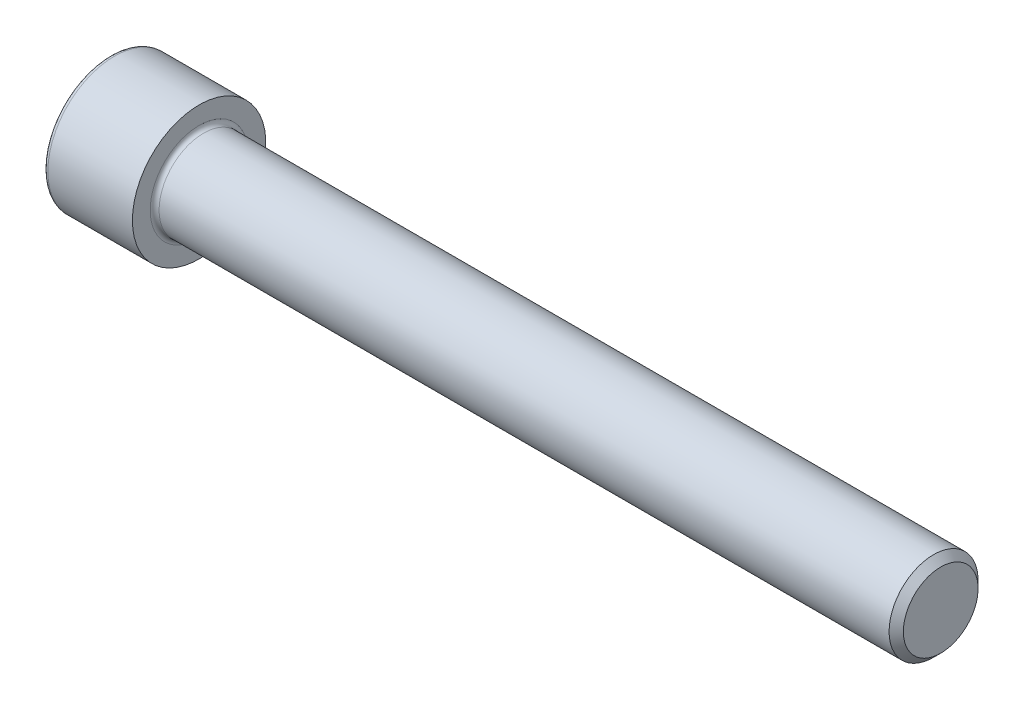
ISO-10303-21;
HEADER;
FILE_DESCRIPTION(('STEP AP214'),'2;1');
FILE_NAME('part.step','',(''),(''),'','','');
FILE_SCHEMA(('AUTOMOTIVE_DESIGN { 1 0 10303 214 1 1 1 1 }'));
ENDSEC;
DATA;
#1=APPLICATION_CONTEXT('core data for automotive mechanical design processes');
#2=APPLICATION_PROTOCOL_DEFINITION('international standard','automotive_design',2000,#1);
#3=PRODUCT_CONTEXT('',#1,'mechanical');
#4=PRODUCT('Part','Part','',(#3));
#5=PRODUCT_RELATED_PRODUCT_CATEGORY('part','',(#4));
#6=PRODUCT_DEFINITION_FORMATION('','',#4);
#7=PRODUCT_DEFINITION_CONTEXT('part definition',#1,'design');
#8=PRODUCT_DEFINITION('design','',#6,#7);
#9=PRODUCT_DEFINITION_SHAPE('','',#8);
#10=(LENGTH_UNIT() NAMED_UNIT(*) SI_UNIT(.MILLI.,.METRE.));
#11=(NAMED_UNIT(*) PLANE_ANGLE_UNIT() SI_UNIT($,.RADIAN.));
#12=(NAMED_UNIT(*) SI_UNIT($,.STERADIAN.) SOLID_ANGLE_UNIT());
#13=UNCERTAINTY_MEASURE_WITH_UNIT(LENGTH_MEASURE(1.E-05),#10,'distance_accuracy_value','');
#14=(GEOMETRIC_REPRESENTATION_CONTEXT(3) GLOBAL_UNCERTAINTY_ASSIGNED_CONTEXT((#13)) GLOBAL_UNIT_ASSIGNED_CONTEXT((#10,
#11,#12)) REPRESENTATION_CONTEXT('',''));
#15=CARTESIAN_POINT('',(0.,0.,0.));
#16=DIRECTION('',(0.,0.,1.));
#17=DIRECTION('',(1.,0.,0.));
#18=AXIS2_PLACEMENT_3D('',#15,#16,#17);
#19=CARTESIAN_POINT('',(0.,0.,0.));
#20=DIRECTION('',(-1.,0.,0.));
#21=DIRECTION('',(0.,0.,1.));
#22=AXIS2_PLACEMENT_3D('',#19,#20,#21);
#23=PLANE('',#22);
#24=DIRECTION('',(0.,-0.499999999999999,0.866025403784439));
#25=VECTOR('',#24,1.);
#26=CARTESIAN_POINT('',(0.,5.83989797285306,0.));
#27=LINE('',#26,#25);
#28=CARTESIAN_POINT('',(0.,5.83989797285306,0.));
#29=VERTEX_POINT('',#28);
#30=CARTESIAN_POINT('',(0.,2.91994898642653,5.05749999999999));
#31=VERTEX_POINT('',#30);
#32=EDGE_CURVE('E266',#29,#31,#27,.T.);
#33=ORIENTED_EDGE('',*,*,#32,.T.);
#34=DIRECTION('',(0.,1.,0.));
#35=VECTOR('',#34,1.);
#36=CARTESIAN_POINT('',(0.,-2.91994898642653,5.05750000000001));
#37=LINE('',#36,#35);
#38=CARTESIAN_POINT('',(0.,-2.91994898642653,5.05750000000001));
#39=VERTEX_POINT('',#38);
#40=EDGE_CURVE('E138',#39,#31,#37,.T.);
#41=ORIENTED_EDGE('',*,*,#40,.F.);
#42=DIRECTION('',(0.,-0.500000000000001,-0.866025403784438));
#43=VECTOR('',#42,1.);
#44=CARTESIAN_POINT('',(0.,-2.91994898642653,5.05750000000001));
#45=LINE('',#44,#43);
#46=CARTESIAN_POINT('',(0.,-5.83989797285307,0.));
#47=VERTEX_POINT('',#46);
#48=EDGE_CURVE('E269',#39,#47,#45,.T.);
#49=ORIENTED_EDGE('',*,*,#48,.T.);
#50=DIRECTION('',(0.,0.499999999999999,-0.866025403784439));
#51=VECTOR('',#50,1.);
#52=CARTESIAN_POINT('',(0.,-5.83989797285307,0.));
#53=LINE('',#52,#51);
#54=CARTESIAN_POINT('',(0.,-2.91994898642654,-5.05749999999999));
#55=VERTEX_POINT('',#54);
#56=EDGE_CURVE('E272',#47,#55,#53,.T.);
#57=ORIENTED_EDGE('',*,*,#56,.T.);
#58=DIRECTION('',(0.,-1.,0.));
#59=VECTOR('',#58,1.);
#60=CARTESIAN_POINT('',(0.,2.91994898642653,-5.05750000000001));
#61=LINE('',#60,#59);
#62=CARTESIAN_POINT('',(0.,2.91994898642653,-5.05750000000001));
#63=VERTEX_POINT('',#62);
#64=EDGE_CURVE('E275',#63,#55,#61,.T.);
#65=ORIENTED_EDGE('',*,*,#64,.F.);
#66=DIRECTION('',(0.,-0.500000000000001,-0.866025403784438));
#67=VECTOR('',#66,1.);
#68=CARTESIAN_POINT('',(0.,5.83989797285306,0.));
#69=LINE('',#68,#67);
#70=EDGE_CURVE('E133',#29,#63,#69,.T.);
#71=ORIENTED_EDGE('',*,*,#70,.F.);
#72=EDGE_LOOP('',(#33,#41,#49,#57,#65,#71));
#73=FACE_BOUND('',#72,.T.);
#74=CARTESIAN_POINT('',(0.,0.,0.));
#75=DIRECTION('',(-1.,0.,0.));
#76=DIRECTION('',(0.,0.,1.));
#77=AXIS2_PLACEMENT_3D('',#74,#75,#76);
#78=CIRCLE('',#77,8.4);
#79=CARTESIAN_POINT('',(0.,0.,8.4));
#80=VERTEX_POINT('',#79);
#81=EDGE_CURVE('E50',#80,#80,#78,.T.);
#82=ORIENTED_EDGE('',*,*,#81,.T.);
#83=EDGE_LOOP('',(#82));
#84=FACE_BOUND('',#83,.T.);
#85=ADVANCED_FACE('F42',(#73,#84),#23,.T.);
#86=CARTESIAN_POINT('',(-31.7499999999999,0.,0.));
#87=DIRECTION('',(-1.,0.,0.));
#88=DIRECTION('',(0.,0.,1.));
#89=AXIS2_PLACEMENT_3D('',#86,#87,#88);
#90=CYLINDRICAL_SURFACE('',#89,9.);
#91=CARTESIAN_POINT('',(0.599999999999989,0.,0.));
#92=DIRECTION('',(-1.,0.,0.));
#93=DIRECTION('',(0.,0.,1.));
#94=AXIS2_PLACEMENT_3D('',#91,#92,#93);
#95=CIRCLE('',#94,9.);
#96=CARTESIAN_POINT('',(0.599999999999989,0.,9.));
#97=VERTEX_POINT('',#96);
#98=EDGE_CURVE('E13',#97,#97,#95,.F.);
#99=ORIENTED_EDGE('',*,*,#98,.T.);
#100=EDGE_LOOP('',(#99));
#101=FACE_BOUND('',#100,.T.);
#102=CARTESIAN_POINT('',(12.,0.,0.));
#103=DIRECTION('',(-1.,0.,0.));
#104=DIRECTION('',(0.,0.,1.));
#105=AXIS2_PLACEMENT_3D('',#102,#103,#104);
#106=CIRCLE('',#105,9.);
#107=CARTESIAN_POINT('',(12.,0.,9.));
#108=VERTEX_POINT('',#107);
#109=EDGE_CURVE('E156',#108,#108,#106,.T.);
#110=ORIENTED_EDGE('',*,*,#109,.T.);
#111=EDGE_LOOP('',(#110));
#112=FACE_BOUND('',#111,.T.);
#113=ADVANCED_FACE('F180',(#101,#112),#90,.T.);
#114=CARTESIAN_POINT('',(12.,8.99999999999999,0.));
#115=DIRECTION('',(1.,0.,0.));
#116=DIRECTION('',(0.,0.,-1.));
#117=AXIS2_PLACEMENT_3D('',#114,#115,#116);
#118=PLANE('',#117);
#119=CARTESIAN_POINT('',(12.,0.,0.));
#120=DIRECTION('',(1.,0.,0.));
#121=DIRECTION('',(0.,0.,-1.));
#122=AXIS2_PLACEMENT_3D('',#119,#120,#121);
#123=CIRCLE('',#122,6.59999999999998);
#124=CARTESIAN_POINT('',(12.,0.,-6.59999999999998));
#125=VERTEX_POINT('',#124);
#126=EDGE_CURVE('E159',#125,#125,#123,.F.);
#127=ORIENTED_EDGE('',*,*,#126,.T.);
#128=EDGE_LOOP('',(#127));
#129=FACE_BOUND('',#128,.T.);
#130=ORIENTED_EDGE('',*,*,#109,.F.);
#131=EDGE_LOOP('',(#130));
#132=FACE_BOUND('',#131,.T.);
#133=ADVANCED_FACE('F186',(#129,#132),#118,.T.);
#134=CARTESIAN_POINT('',(-31.7499999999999,0.,0.));
#135=DIRECTION('',(-1.,0.,0.));
#136=DIRECTION('',(0.,0.,1.));
#137=AXIS2_PLACEMENT_3D('',#134,#135,#136);
#138=CYLINDRICAL_SURFACE('',#137,5.99999999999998);
#139=CARTESIAN_POINT('',(12.6,0.,0.));
#140=DIRECTION('',(1.,0.,0.));
#141=DIRECTION('',(0.,0.,-1.));
#142=AXIS2_PLACEMENT_3D('',#139,#140,#141);
#143=CIRCLE('',#142,5.99999999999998);
#144=CARTESIAN_POINT('',(12.6,0.,-5.99999999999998));
#145=VERTEX_POINT('',#144);
#146=EDGE_CURVE('E162',#145,#145,#143,.T.);
#147=ORIENTED_EDGE('',*,*,#146,.T.);
#148=EDGE_LOOP('',(#147));
#149=FACE_BOUND('',#148,.T.);
#150=CARTESIAN_POINT('',(111.036,0.,0.));
#151=DIRECTION('',(-1.,0.,0.));
#152=DIRECTION('',(0.,0.,1.));
#153=AXIS2_PLACEMENT_3D('',#150,#151,#152);
#154=CIRCLE('',#153,5.99999999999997);
#155=CARTESIAN_POINT('',(111.036,0.,5.99999999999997));
#156=VERTEX_POINT('',#155);
#157=EDGE_CURVE('E153',#156,#156,#154,.T.);
#158=ORIENTED_EDGE('',*,*,#157,.T.);
#159=EDGE_LOOP('',(#158));
#160=FACE_BOUND('',#159,.T.);
#161=ADVANCED_FACE('F192',(#149,#160),#138,.T.);
#162=CARTESIAN_POINT('',(112.,0.,0.));
#163=DIRECTION('',(-1.,0.,0.));
#164=DIRECTION('',(0.,0.,1.));
#165=AXIS2_PLACEMENT_3D('',#162,#163,#164);
#166=CONICAL_SURFACE('',#165,5.036,0.785398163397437);
#167=ORIENTED_EDGE('',*,*,#157,.F.);
#168=EDGE_LOOP('',(#167));
#169=FACE_BOUND('',#168,.T.);
#170=CARTESIAN_POINT('',(112.,0.,0.));
#171=DIRECTION('',(-1.,0.,0.));
#172=DIRECTION('',(0.,0.,1.));
#173=AXIS2_PLACEMENT_3D('',#170,#171,#172);
#174=CIRCLE('',#173,5.036);
#175=CARTESIAN_POINT('',(112.,0.,5.036));
#176=VERTEX_POINT('',#175);
#177=EDGE_CURVE('E149',#176,#176,#174,.T.);
#178=ORIENTED_EDGE('',*,*,#177,.T.);
#179=EDGE_LOOP('',(#178));
#180=FACE_BOUND('',#179,.T.);
#181=ADVANCED_FACE('F196',(#169,#180),#166,.T.);
#182=CARTESIAN_POINT('',(112.,5.036,0.));
#183=DIRECTION('',(1.,0.,0.));
#184=DIRECTION('',(0.,0.,-1.));
#185=AXIS2_PLACEMENT_3D('',#182,#183,#184);
#186=PLANE('',#185);
#187=ORIENTED_EDGE('',*,*,#177,.F.);
#188=EDGE_LOOP('',(#187));
#189=FACE_BOUND('',#188,.T.);
#190=ADVANCED_FACE('F176',(#189),#186,.T.);
#191=CARTESIAN_POINT('',(12.6,0.,0.));
#192=DIRECTION('',(1.,0.,0.));
#193=DIRECTION('',(0.,0.,-1.));
#194=AXIS2_PLACEMENT_3D('',#191,#192,#193);
#195=TOROIDAL_SURFACE('',#194,6.59999999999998,0.6);
#196=ORIENTED_EDGE('',*,*,#146,.F.);
#197=EDGE_LOOP('',(#196));
#198=FACE_BOUND('',#197,.T.);
#199=ORIENTED_EDGE('',*,*,#126,.F.);
#200=EDGE_LOOP('',(#199));
#201=FACE_BOUND('',#200,.T.);
#202=ADVANCED_FACE('F169',(#198,#201),#195,.F.);
#203=CARTESIAN_POINT('',(0.599999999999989,0.,0.));
#204=DIRECTION('',(-1.,0.,0.));
#205=DIRECTION('',(0.,0.,1.));
#206=AXIS2_PLACEMENT_3D('',#203,#204,#205);
#207=TOROIDAL_SURFACE('',#206,8.4,0.6);
#208=ORIENTED_EDGE('',*,*,#98,.F.);
#209=EDGE_LOOP('',(#208));
#210=FACE_BOUND('',#209,.T.);
#211=ORIENTED_EDGE('',*,*,#81,.F.);
#212=EDGE_LOOP('',(#211));
#213=FACE_BOUND('',#212,.T.);
#214=ADVANCED_FACE('F44',(#210,#213),#207,.T.);
#215=CARTESIAN_POINT('',(6.00000000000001,5.83989797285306,0.));
#216=DIRECTION('',(0.,-0.866025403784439,-0.499999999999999));
#217=DIRECTION('',(0.,0.499999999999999,-0.866025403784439));
#218=AXIS2_PLACEMENT_3D('',#215,#216,#217);
#219=PLANE('',#218);
#220=ORIENTED_EDGE('',*,*,#32,.F.);
#221=DIRECTION('',(-1.,0.,0.));
#222=VECTOR('',#221,1.);
#223=CARTESIAN_POINT('',(6.00000000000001,5.83989797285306,0.));
#224=LINE('',#223,#222);
#225=CARTESIAN_POINT('',(6.00000000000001,5.83989797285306,0.));
#226=VERTEX_POINT('',#225);
#227=EDGE_CURVE('E256',#226,#29,#224,.T.);
#228=ORIENTED_EDGE('',*,*,#227,.F.);
#229=DIRECTION('',(0.,-0.499999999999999,0.866025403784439));
#230=VECTOR('',#229,1.);
#231=CARTESIAN_POINT('',(6.00000000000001,5.83989797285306,0.));
#232=LINE('',#231,#230);
#233=CARTESIAN_POINT('',(6.00000000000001,4.37992347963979,2.52875));
#234=VERTEX_POINT('',#233);
#235=EDGE_CURVE('E125',#226,#234,#232,.T.);
#236=ORIENTED_EDGE('',*,*,#235,.T.);
#237=CARTESIAN_POINT('',(6.00000000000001,2.91994898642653,5.05749999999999));
#238=VERTEX_POINT('',#237);
#239=EDGE_CURVE('E116',#234,#238,#232,.T.);
#240=ORIENTED_EDGE('',*,*,#239,.T.);
#241=DIRECTION('',(-1.,0.,0.));
#242=VECTOR('',#241,1.);
#243=CARTESIAN_POINT('',(6.00000000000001,2.91994898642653,5.05749999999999));
#244=LINE('',#243,#242);
#245=EDGE_CURVE('E130',#238,#31,#244,.T.);
#246=ORIENTED_EDGE('',*,*,#245,.T.);
#247=EDGE_LOOP('',(#220,#228,#236,#240,#246));
#248=FACE_BOUND('',#247,.T.);
#249=ADVANCED_FACE('F129',(#248),#219,.T.);
#250=CARTESIAN_POINT('',(6.00000000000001,-2.91994898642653,5.05750000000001));
#251=DIRECTION('',(0.,0.,1.));
#252=DIRECTION('',(0.,-1.,0.));
#253=AXIS2_PLACEMENT_3D('',#250,#251,#252);
#254=PLANE('',#253);
#255=ORIENTED_EDGE('',*,*,#40,.T.);
#256=ORIENTED_EDGE('',*,*,#245,.F.);
#257=DIRECTION('',(0.,1.,0.));
#258=VECTOR('',#257,1.);
#259=CARTESIAN_POINT('',(6.00000000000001,-2.91994898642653,5.05750000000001));
#260=LINE('',#259,#258);
#261=CARTESIAN_POINT('',(6.00000000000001,0.,5.05749999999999));
#262=VERTEX_POINT('',#261);
#263=EDGE_CURVE('E113',#262,#238,#260,.T.);
#264=ORIENTED_EDGE('',*,*,#263,.F.);
#265=CARTESIAN_POINT('',(6.00000000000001,-2.91994898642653,5.05750000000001));
#266=VERTEX_POINT('',#265);
#267=EDGE_CURVE('E124',#266,#262,#260,.T.);
#268=ORIENTED_EDGE('',*,*,#267,.F.);
#269=DIRECTION('',(-1.,0.,0.));
#270=VECTOR('',#269,1.);
#271=CARTESIAN_POINT('',(6.00000000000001,-2.91994898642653,5.05750000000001));
#272=LINE('',#271,#270);
#273=EDGE_CURVE('E140',#266,#39,#272,.T.);
#274=ORIENTED_EDGE('',*,*,#273,.T.);
#275=EDGE_LOOP('',(#255,#256,#264,#268,#274));
#276=FACE_BOUND('',#275,.T.);
#277=ADVANCED_FACE('F135',(#276),#254,.F.);
#278=CARTESIAN_POINT('',(6.00000000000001,-2.91994898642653,5.05750000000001));
#279=DIRECTION('',(0.,0.866025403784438,-0.500000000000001));
#280=DIRECTION('',(0.,0.500000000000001,0.866025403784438));
#281=AXIS2_PLACEMENT_3D('',#278,#279,#280);
#282=PLANE('',#281);
#283=ORIENTED_EDGE('',*,*,#48,.F.);
#284=ORIENTED_EDGE('',*,*,#273,.F.);
#285=DIRECTION('',(0.,-0.500000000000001,-0.866025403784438));
#286=VECTOR('',#285,1.);
#287=CARTESIAN_POINT('',(6.00000000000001,-2.91994898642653,5.05750000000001));
#288=LINE('',#287,#286);
#289=CARTESIAN_POINT('',(6.00000000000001,-4.37992347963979,2.52875000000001));
#290=VERTEX_POINT('',#289);
#291=EDGE_CURVE('E295',#266,#290,#288,.T.);
#292=ORIENTED_EDGE('',*,*,#291,.T.);
#293=CARTESIAN_POINT('',(6.00000000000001,-5.83989797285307,0.));
#294=VERTEX_POINT('',#293);
#295=EDGE_CURVE('E284',#290,#294,#288,.T.);
#296=ORIENTED_EDGE('',*,*,#295,.T.);
#297=DIRECTION('',(-1.,0.,0.));
#298=VECTOR('',#297,1.);
#299=CARTESIAN_POINT('',(6.00000000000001,-5.83989797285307,0.));
#300=LINE('',#299,#298);
#301=EDGE_CURVE('E145',#294,#47,#300,.T.);
#302=ORIENTED_EDGE('',*,*,#301,.T.);
#303=EDGE_LOOP('',(#283,#284,#292,#296,#302));
#304=FACE_BOUND('',#303,.T.);
#305=ADVANCED_FACE('F210',(#304),#282,.T.);
#306=CARTESIAN_POINT('',(6.00000000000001,-5.83989797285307,0.));
#307=DIRECTION('',(0.,0.866025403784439,0.499999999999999));
#308=DIRECTION('',(0.,-0.499999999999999,0.866025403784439));
#309=AXIS2_PLACEMENT_3D('',#306,#307,#308);
#310=PLANE('',#309);
#311=ORIENTED_EDGE('',*,*,#56,.F.);
#312=ORIENTED_EDGE('',*,*,#301,.F.);
#313=DIRECTION('',(0.,0.499999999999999,-0.866025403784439));
#314=VECTOR('',#313,1.);
#315=CARTESIAN_POINT('',(6.00000000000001,-5.83989797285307,0.));
#316=LINE('',#315,#314);
#317=CARTESIAN_POINT('',(6.00000000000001,-4.37992347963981,-2.52875));
#318=VERTEX_POINT('',#317);
#319=EDGE_CURVE('E262',#294,#318,#316,.T.);
#320=ORIENTED_EDGE('',*,*,#319,.T.);
#321=CARTESIAN_POINT('',(6.00000000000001,-2.91994898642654,-5.05749999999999));
#322=VERTEX_POINT('',#321);
#323=EDGE_CURVE('E294',#318,#322,#316,.T.);
#324=ORIENTED_EDGE('',*,*,#323,.T.);
#325=DIRECTION('',(-1.,0.,0.));
#326=VECTOR('',#325,1.);
#327=CARTESIAN_POINT('',(6.00000000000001,-2.91994898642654,-5.05749999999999));
#328=LINE('',#327,#326);
#329=EDGE_CURVE('E255',#322,#55,#328,.T.);
#330=ORIENTED_EDGE('',*,*,#329,.T.);
#331=EDGE_LOOP('',(#311,#312,#320,#324,#330));
#332=FACE_BOUND('',#331,.T.);
#333=ADVANCED_FACE('F213',(#332),#310,.T.);
#334=CARTESIAN_POINT('',(6.00000000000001,2.91994898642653,-5.05750000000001));
#335=DIRECTION('',(0.,0.,-1.));
#336=DIRECTION('',(0.,1.,0.));
#337=AXIS2_PLACEMENT_3D('',#334,#335,#336);
#338=PLANE('',#337);
#339=ORIENTED_EDGE('',*,*,#64,.T.);
#340=ORIENTED_EDGE('',*,*,#329,.F.);
#341=DIRECTION('',(0.,-1.,0.));
#342=VECTOR('',#341,1.);
#343=CARTESIAN_POINT('',(6.00000000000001,2.91994898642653,-5.05750000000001));
#344=LINE('',#343,#342);
#345=CARTESIAN_POINT('',(6.00000000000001,0.,-5.05750000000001));
#346=VERTEX_POINT('',#345);
#347=EDGE_CURVE('E259',#346,#322,#344,.T.);
#348=ORIENTED_EDGE('',*,*,#347,.F.);
#349=CARTESIAN_POINT('',(6.00000000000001,2.91994898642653,-5.05750000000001));
#350=VERTEX_POINT('',#349);
#351=EDGE_CURVE('E57',#350,#346,#344,.T.);
#352=ORIENTED_EDGE('',*,*,#351,.F.);
#353=DIRECTION('',(-1.,0.,0.));
#354=VECTOR('',#353,1.);
#355=CARTESIAN_POINT('',(6.00000000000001,2.91994898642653,-5.05750000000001));
#356=LINE('',#355,#354);
#357=EDGE_CURVE('E252',#350,#63,#356,.T.);
#358=ORIENTED_EDGE('',*,*,#357,.T.);
#359=EDGE_LOOP('',(#339,#340,#348,#352,#358));
#360=FACE_BOUND('',#359,.T.);
#361=ADVANCED_FACE('F217',(#360),#338,.F.);
#362=CARTESIAN_POINT('',(6.00000000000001,5.83989797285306,0.));
#363=DIRECTION('',(0.,0.866025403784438,-0.500000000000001));
#364=DIRECTION('',(0.,0.500000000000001,0.866025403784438));
#365=AXIS2_PLACEMENT_3D('',#362,#363,#364);
#366=PLANE('',#365);
#367=ORIENTED_EDGE('',*,*,#70,.T.);
#368=ORIENTED_EDGE('',*,*,#357,.F.);
#369=DIRECTION('',(0.,-0.500000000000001,-0.866025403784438));
#370=VECTOR('',#369,1.);
#371=CARTESIAN_POINT('',(6.00000000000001,5.83989797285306,0.));
#372=LINE('',#371,#370);
#373=CARTESIAN_POINT('',(6.00000000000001,4.37992347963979,-2.52875000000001));
#374=VERTEX_POINT('',#373);
#375=EDGE_CURVE('E242',#374,#350,#372,.T.);
#376=ORIENTED_EDGE('',*,*,#375,.F.);
#377=EDGE_CURVE('E248',#226,#374,#372,.T.);
#378=ORIENTED_EDGE('',*,*,#377,.F.);
#379=ORIENTED_EDGE('',*,*,#227,.T.);
#380=EDGE_LOOP('',(#367,#368,#376,#378,#379));
#381=FACE_BOUND('',#380,.T.);
#382=ADVANCED_FACE('F221',(#381),#366,.F.);
#383=CARTESIAN_POINT('',(6.00000000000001,5.83989797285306,0.));
#384=DIRECTION('',(1.,0.,0.));
#385=DIRECTION('',(0.,0.,-1.));
#386=AXIS2_PLACEMENT_3D('',#383,#384,#385);
#387=PLANE('',#386);
#388=ORIENTED_EDGE('',*,*,#347,.T.);
#389=ORIENTED_EDGE('',*,*,#323,.F.);
#390=CARTESIAN_POINT('',(6.00000000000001,0.,0.));
#391=DIRECTION('',(-1.,0.,0.));
#392=DIRECTION('',(0.,0.,1.));
#393=AXIS2_PLACEMENT_3D('',#390,#391,#392);
#394=CIRCLE('',#393,5.0575);
#395=EDGE_CURVE('E290',#346,#318,#394,.T.);
#396=ORIENTED_EDGE('',*,*,#395,.F.);
#397=EDGE_LOOP('',(#388,#389,#396));
#398=FACE_BOUND('',#397,.T.);
#399=ADVANCED_FACE('F225',(#398),#387,.F.);
#400=ORIENTED_EDGE('',*,*,#319,.F.);
#401=ORIENTED_EDGE('',*,*,#295,.F.);
#402=EDGE_CURVE('E143',#318,#290,#394,.T.);
#403=ORIENTED_EDGE('',*,*,#402,.F.);
#404=EDGE_LOOP('',(#400,#401,#403));
#405=FACE_BOUND('',#404,.T.);
#406=ADVANCED_FACE('F228',(#405),#387,.F.);
#407=ORIENTED_EDGE('',*,*,#291,.F.);
#408=ORIENTED_EDGE('',*,*,#267,.T.);
#409=EDGE_CURVE('E139',#290,#262,#394,.T.);
#410=ORIENTED_EDGE('',*,*,#409,.F.);
#411=EDGE_LOOP('',(#407,#408,#410));
#412=FACE_BOUND('',#411,.T.);
#413=ADVANCED_FACE('F233',(#412),#387,.F.);
#414=ORIENTED_EDGE('',*,*,#263,.T.);
#415=ORIENTED_EDGE('',*,*,#239,.F.);
#416=EDGE_CURVE('E119',#262,#234,#394,.T.);
#417=ORIENTED_EDGE('',*,*,#416,.F.);
#418=EDGE_LOOP('',(#414,#415,#417));
#419=FACE_BOUND('',#418,.T.);
#420=ADVANCED_FACE('F115',(#419),#387,.F.);
#421=ORIENTED_EDGE('',*,*,#235,.F.);
#422=ORIENTED_EDGE('',*,*,#377,.T.);
#423=EDGE_CURVE('E150',#234,#374,#394,.T.);
#424=ORIENTED_EDGE('',*,*,#423,.F.);
#425=EDGE_LOOP('',(#421,#422,#424));
#426=FACE_BOUND('',#425,.T.);
#427=ADVANCED_FACE('F236',(#426),#387,.F.);
#428=ORIENTED_EDGE('',*,*,#375,.T.);
#429=ORIENTED_EDGE('',*,*,#351,.T.);
#430=EDGE_CURVE('E245',#374,#346,#394,.T.);
#431=ORIENTED_EDGE('',*,*,#430,.F.);
#432=EDGE_LOOP('',(#428,#429,#431));
#433=FACE_BOUND('',#432,.T.);
#434=ADVANCED_FACE('F206',(#433),#387,.F.);
#435=CARTESIAN_POINT('',(6.00000000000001,0.,0.));
#436=DIRECTION('',(-1.,0.,0.));
#437=DIRECTION('',(0.,0.,1.));
#438=AXIS2_PLACEMENT_3D('',#435,#436,#437);
#439=CONICAL_SURFACE('',#438,5.0575,1.04719755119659);
#440=CARTESIAN_POINT('',(8.91994898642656,0.,0.));
#441=VERTEX_POINT('',#440);
#442=VERTEX_LOOP('',#441);
#443=FACE_BOUND('',#442,.T.);
#444=ORIENTED_EDGE('',*,*,#416,.T.);
#445=ORIENTED_EDGE('',*,*,#423,.T.);
#446=ORIENTED_EDGE('',*,*,#430,.T.);
#447=ORIENTED_EDGE('',*,*,#395,.T.);
#448=ORIENTED_EDGE('',*,*,#402,.T.);
#449=ORIENTED_EDGE('',*,*,#409,.T.);
#450=EDGE_LOOP('',(#444,#445,#446,#447,#448,#449));
#451=FACE_BOUND('',#450,.T.);
#452=ADVANCED_FACE('F204',(#443,#451),#439,.F.);
#453=CLOSED_SHELL('',(#85,#113,#133,#161,#181,#190,#202,#214,#249,#277,#305,#333,#361,#382,#399,
#406,#413,#420,#427,#434,#452));
#454=MANIFOLD_SOLID_BREP('B2',#453);
#455=ADVANCED_BREP_SHAPE_REPRESENTATION('',(#18,#454),#14);
#456=SHAPE_DEFINITION_REPRESENTATION(#9,#455);
ENDSEC;
END-ISO-10303-21;
